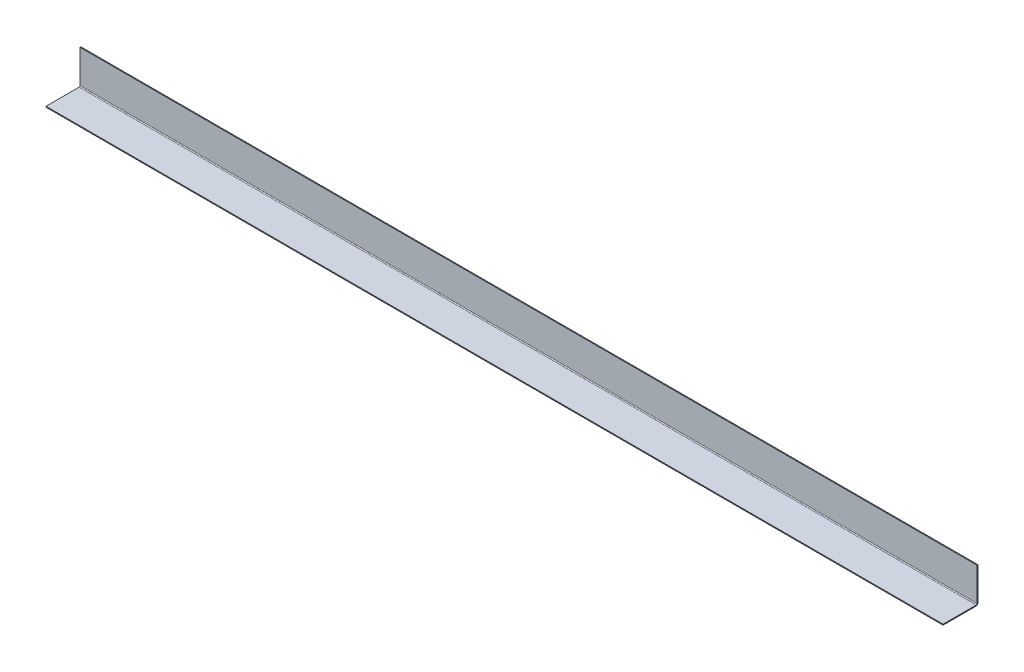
ISO-10303-21;
HEADER;
FILE_DESCRIPTION(('STEP AP214'),'2;1');
FILE_NAME('part.step','',(''),(''),'','','');
FILE_SCHEMA(('AUTOMOTIVE_DESIGN { 1 0 10303 214 1 1 1 1 }'));
ENDSEC;
DATA;
#1=APPLICATION_CONTEXT('core data for automotive mechanical design processes');
#2=APPLICATION_PROTOCOL_DEFINITION('international standard','automotive_design',2000,#1);
#3=PRODUCT_CONTEXT('',#1,'mechanical');
#4=PRODUCT('Part','Part','',(#3));
#5=PRODUCT_RELATED_PRODUCT_CATEGORY('part','',(#4));
#6=PRODUCT_DEFINITION_FORMATION('','',#4);
#7=PRODUCT_DEFINITION_CONTEXT('part definition',#1,'design');
#8=PRODUCT_DEFINITION('design','',#6,#7);
#9=PRODUCT_DEFINITION_SHAPE('','',#8);
#10=(LENGTH_UNIT() NAMED_UNIT(*) SI_UNIT(.MILLI.,.METRE.));
#11=(NAMED_UNIT(*) PLANE_ANGLE_UNIT() SI_UNIT($,.RADIAN.));
#12=(NAMED_UNIT(*) SI_UNIT($,.STERADIAN.) SOLID_ANGLE_UNIT());
#13=UNCERTAINTY_MEASURE_WITH_UNIT(LENGTH_MEASURE(1.E-05),#10,'distance_accuracy_value','');
#14=(GEOMETRIC_REPRESENTATION_CONTEXT(3) GLOBAL_UNCERTAINTY_ASSIGNED_CONTEXT((#13)) GLOBAL_UNIT_ASSIGNED_CONTEXT((#10,
#11,#12)) REPRESENTATION_CONTEXT('',''));
#15=CARTESIAN_POINT('',(0.,0.,0.));
#16=DIRECTION('',(0.,0.,1.));
#17=DIRECTION('',(1.,0.,0.));
#18=AXIS2_PLACEMENT_3D('',#15,#16,#17);
#19=CARTESIAN_POINT('',(1000.,0.356194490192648,77.8438055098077));
#20=DIRECTION('',(0.,1.,0.));
#21=DIRECTION('',(1.,0.,0.));
#22=AXIS2_PLACEMENT_3D('',#19,#20,#21);
#23=PLANE('',#22);
#24=DIRECTION('',(0.,0.,-1.));
#25=VECTOR('',#24,1.);
#26=CARTESIAN_POINT('',(1000.,0.356194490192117,-74.5561944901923));
#27=LINE('',#26,#25);
#28=CARTESIAN_POINT('',(1000.,0.356194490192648,77.8438055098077));
#29=VERTEX_POINT('',#28);
#30=CARTESIAN_POINT('',(1000.,0.356194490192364,4.00000000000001));
#31=VERTEX_POINT('',#30);
#32=EDGE_CURVE('E46',#29,#31,#27,.T.);
#33=ORIENTED_EDGE('',*,*,#32,.T.);
#34=DIRECTION('',(-1.,0.,0.));
#35=VECTOR('',#34,1.);
#36=CARTESIAN_POINT('',(1000.,0.356194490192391,4.00000000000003));
#37=LINE('',#36,#35);
#38=CARTESIAN_POINT('',(-1000.,0.356194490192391,4.00000000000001));
#39=VERTEX_POINT('',#38);
#40=EDGE_CURVE('E113',#31,#39,#37,.T.);
#41=ORIENTED_EDGE('',*,*,#40,.T.);
#42=DIRECTION('',(0.,0.,1.));
#43=VECTOR('',#42,1.);
#44=CARTESIAN_POINT('',(-1000.,0.356194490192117,-74.5561944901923));
#45=LINE('',#44,#43);
#46=CARTESIAN_POINT('',(-1000.,0.356194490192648,77.8438055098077));
#47=VERTEX_POINT('',#46);
#48=EDGE_CURVE('E108',#39,#47,#45,.T.);
#49=ORIENTED_EDGE('',*,*,#48,.T.);
#50=DIRECTION('',(1.,0.,0.));
#51=VECTOR('',#50,1.);
#52=CARTESIAN_POINT('',(-1000.,0.356194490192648,77.8438055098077));
#53=LINE('',#52,#51);
#54=EDGE_CURVE('E67',#47,#29,#53,.T.);
#55=ORIENTED_EDGE('',*,*,#54,.T.);
#56=EDGE_LOOP('',(#33,#41,#49,#55));
#57=FACE_BOUND('',#56,.T.);
#58=ADVANCED_FACE('F42',(#57),#23,.T.);
#59=CARTESIAN_POINT('',(1000.,0.356194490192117,-74.5561944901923));
#60=DIRECTION('',(-1.,0.,0.));
#61=DIRECTION('',(0.,1.,0.));
#62=AXIS2_PLACEMENT_3D('',#59,#60,#61);
#63=PLANE('',#62);
#64=DIRECTION('',(0.,-1.,0.));
#65=VECTOR('',#64,1.);
#66=CARTESIAN_POINT('',(1000.,0.356194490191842,4.00000000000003));
#67=LINE('',#66,#65);
#68=CARTESIAN_POINT('',(1000.,-1.64380550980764,4.00000000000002));
#69=VERTEX_POINT('',#68);
#70=EDGE_CURVE('E118',#31,#69,#67,.T.);
#71=ORIENTED_EDGE('',*,*,#70,.F.);
#72=ORIENTED_EDGE('',*,*,#32,.F.);
#73=DIRECTION('',(0.,-1.,0.));
#74=VECTOR('',#73,1.);
#75=CARTESIAN_POINT('',(1000.,0.356194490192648,77.8438055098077));
#76=LINE('',#75,#74);
#77=CARTESIAN_POINT('',(1000.,-1.64380550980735,77.8438055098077));
#78=VERTEX_POINT('',#77);
#79=EDGE_CURVE('E83',#29,#78,#76,.T.);
#80=ORIENTED_EDGE('',*,*,#79,.T.);
#81=DIRECTION('',(0.,0.,-1.));
#82=VECTOR('',#81,1.);
#83=CARTESIAN_POINT('',(1000.,-1.64380550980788,-74.5561944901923));
#84=LINE('',#83,#82);
#85=EDGE_CURVE('E97',#78,#69,#84,.T.);
#86=ORIENTED_EDGE('',*,*,#85,.T.);
#87=EDGE_LOOP('',(#71,#72,#80,#86));
#88=FACE_BOUND('',#87,.T.);
#89=ADVANCED_FACE('F95',(#88),#63,.F.);
#90=CARTESIAN_POINT('',(-1000.,0.356194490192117,-74.5561944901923));
#91=DIRECTION('',(1.,0.,0.));
#92=DIRECTION('',(0.,-1.,0.));
#93=AXIS2_PLACEMENT_3D('',#90,#91,#92);
#94=PLANE('',#93);
#95=DIRECTION('',(0.,1.,0.));
#96=VECTOR('',#95,1.);
#97=CARTESIAN_POINT('',(-1000.,0.356194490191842,4.00000000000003));
#98=LINE('',#97,#96);
#99=CARTESIAN_POINT('',(-1000.,-1.64380550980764,4.00000000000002));
#100=VERTEX_POINT('',#99);
#101=EDGE_CURVE('E12',#100,#39,#98,.T.);
#102=ORIENTED_EDGE('',*,*,#101,.F.);
#103=DIRECTION('',(0.,0.,1.));
#104=VECTOR('',#103,1.);
#105=CARTESIAN_POINT('',(-1000.,-1.64380550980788,-74.5561944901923));
#106=LINE('',#105,#104);
#107=CARTESIAN_POINT('',(-1000.,-1.64380550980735,77.8438055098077));
#108=VERTEX_POINT('',#107);
#109=EDGE_CURVE('E90',#100,#108,#106,.T.);
#110=ORIENTED_EDGE('',*,*,#109,.T.);
#111=DIRECTION('',(0.,-1.,0.));
#112=VECTOR('',#111,1.);
#113=CARTESIAN_POINT('',(-1000.,0.356194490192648,77.8438055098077));
#114=LINE('',#113,#112);
#115=EDGE_CURVE('E86',#47,#108,#114,.T.);
#116=ORIENTED_EDGE('',*,*,#115,.F.);
#117=ORIENTED_EDGE('',*,*,#48,.F.);
#118=EDGE_LOOP('',(#102,#110,#116,#117));
#119=FACE_BOUND('',#118,.T.);
#120=ADVANCED_FACE('F44',(#119),#94,.F.);
#121=CARTESIAN_POINT('',(-1000.,0.356194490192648,77.8438055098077));
#122=DIRECTION('',(0.,0.,-1.));
#123=DIRECTION('',(0.,1.,0.));
#124=AXIS2_PLACEMENT_3D('',#121,#122,#123);
#125=PLANE('',#124);
#126=DIRECTION('',(1.,0.,0.));
#127=VECTOR('',#126,1.);
#128=CARTESIAN_POINT('',(-1000.,-1.64380550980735,77.8438055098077));
#129=LINE('',#128,#127);
#130=EDGE_CURVE('E80',#108,#78,#129,.T.);
#131=ORIENTED_EDGE('',*,*,#130,.T.);
#132=ORIENTED_EDGE('',*,*,#79,.F.);
#133=ORIENTED_EDGE('',*,*,#54,.F.);
#134=ORIENTED_EDGE('',*,*,#115,.T.);
#135=EDGE_LOOP('',(#131,#132,#133,#134));
#136=FACE_BOUND('',#135,.T.);
#137=ADVANCED_FACE('F82',(#136),#125,.F.);
#138=CARTESIAN_POINT('',(1000.,-1.64380550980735,77.8438055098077));
#139=DIRECTION('',(0.,1.,0.));
#140=DIRECTION('',(1.,0.,0.));
#141=AXIS2_PLACEMENT_3D('',#138,#139,#140);
#142=PLANE('',#141);
#143=DIRECTION('',(-1.,0.,0.));
#144=VECTOR('',#143,1.);
#145=CARTESIAN_POINT('',(1000.,-1.64380550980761,4.00000000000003));
#146=LINE('',#145,#144);
#147=EDGE_CURVE('E51',#69,#100,#146,.T.);
#148=ORIENTED_EDGE('',*,*,#147,.F.);
#149=ORIENTED_EDGE('',*,*,#85,.F.);
#150=ORIENTED_EDGE('',*,*,#130,.F.);
#151=ORIENTED_EDGE('',*,*,#109,.F.);
#152=EDGE_LOOP('',(#148,#149,#150,#151));
#153=FACE_BOUND('',#152,.T.);
#154=ADVANCED_FACE('F100',(#153),#142,.F.);
#155=CARTESIAN_POINT('',(-1000.,76.2,2.));
#156=DIRECTION('',(0.,-1.,0.));
#157=DIRECTION('',(0.,0.,-1.));
#158=AXIS2_PLACEMENT_3D('',#155,#156,#157);
#159=PLANE('',#158);
#160=DIRECTION('',(-1.,0.,0.));
#161=VECTOR('',#160,1.);
#162=CARTESIAN_POINT('',(-1000.,76.2,0.));
#163=LINE('',#162,#161);
#164=CARTESIAN_POINT('',(1000.,76.2,0.));
#165=VERTEX_POINT('',#164);
#166=CARTESIAN_POINT('',(-1000.,76.2,0.));
#167=VERTEX_POINT('',#166);
#168=EDGE_CURVE('E130',#165,#167,#163,.T.);
#169=ORIENTED_EDGE('',*,*,#168,.T.);
#170=DIRECTION('',(0.,0.,-1.));
#171=VECTOR('',#170,1.);
#172=CARTESIAN_POINT('',(-1000.,76.2,2.));
#173=LINE('',#172,#171);
#174=CARTESIAN_POINT('',(-1000.,76.2,2.));
#175=VERTEX_POINT('',#174);
#176=EDGE_CURVE('E102',#175,#167,#173,.T.);
#177=ORIENTED_EDGE('',*,*,#176,.F.);
#178=DIRECTION('',(-1.,0.,0.));
#179=VECTOR('',#178,1.);
#180=CARTESIAN_POINT('',(-1000.,76.2,2.));
#181=LINE('',#180,#179);
#182=CARTESIAN_POINT('',(1000.,76.2,2.));
#183=VERTEX_POINT('',#182);
#184=EDGE_CURVE('E139',#183,#175,#181,.T.);
#185=ORIENTED_EDGE('',*,*,#184,.F.);
#186=DIRECTION('',(0.,0.,-1.));
#187=VECTOR('',#186,1.);
#188=CARTESIAN_POINT('',(1000.,76.2,2.));
#189=LINE('',#188,#187);
#190=EDGE_CURVE('E133',#183,#165,#189,.T.);
#191=ORIENTED_EDGE('',*,*,#190,.T.);
#192=EDGE_LOOP('',(#169,#177,#185,#191));
#193=FACE_BOUND('',#192,.T.);
#194=ADVANCED_FACE('F188',(#193),#159,.F.);
#195=CARTESIAN_POINT('',(1000.,-76.2,2.));
#196=DIRECTION('',(0.,0.,1.));
#197=DIRECTION('',(1.,0.,0.));
#198=AXIS2_PLACEMENT_3D('',#195,#196,#197);
#199=PLANE('',#198);
#200=DIRECTION('',(-1.,0.,0.));
#201=VECTOR('',#200,1.);
#202=CARTESIAN_POINT('',(1000.,2.35619449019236,2.));
#203=LINE('',#202,#201);
#204=CARTESIAN_POINT('',(1000.,2.35619449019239,2.));
#205=VERTEX_POINT('',#204);
#206=CARTESIAN_POINT('',(-1000.,2.35619449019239,2.));
#207=VERTEX_POINT('',#206);
#208=EDGE_CURVE('E128',#205,#207,#203,.T.);
#209=ORIENTED_EDGE('',*,*,#208,.F.);
#210=DIRECTION('',(0.,1.,0.));
#211=VECTOR('',#210,1.);
#212=CARTESIAN_POINT('',(1000.,76.2,2.));
#213=LINE('',#212,#211);
#214=EDGE_CURVE('E136',#205,#183,#213,.T.);
#215=ORIENTED_EDGE('',*,*,#214,.T.);
#216=ORIENTED_EDGE('',*,*,#184,.T.);
#217=DIRECTION('',(0.,-1.,0.));
#218=VECTOR('',#217,1.);
#219=CARTESIAN_POINT('',(-1000.,76.2,2.));
#220=LINE('',#219,#218);
#221=EDGE_CURVE('E142',#175,#207,#220,.T.);
#222=ORIENTED_EDGE('',*,*,#221,.T.);
#223=EDGE_LOOP('',(#209,#215,#216,#222));
#224=FACE_BOUND('',#223,.T.);
#225=ADVANCED_FACE('F174',(#224),#199,.T.);
#226=CARTESIAN_POINT('',(1000.,76.2,2.));
#227=DIRECTION('',(-1.,0.,0.));
#228=DIRECTION('',(0.,0.,1.));
#229=AXIS2_PLACEMENT_3D('',#226,#227,#228);
#230=PLANE('',#229);
#231=ORIENTED_EDGE('',*,*,#214,.F.);
#232=DIRECTION('',(0.,0.,-1.));
#233=VECTOR('',#232,1.);
#234=CARTESIAN_POINT('',(1000.,2.35619449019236,1.99999999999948));
#235=LINE('',#234,#233);
#236=CARTESIAN_POINT('',(1000.,2.35619449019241,0.));
#237=VERTEX_POINT('',#236);
#238=EDGE_CURVE('E145',#205,#237,#235,.T.);
#239=ORIENTED_EDGE('',*,*,#238,.T.);
#240=DIRECTION('',(0.,1.,0.));
#241=VECTOR('',#240,1.);
#242=CARTESIAN_POINT('',(1000.,76.2,0.));
#243=LINE('',#242,#241);
#244=EDGE_CURVE('E148',#237,#165,#243,.T.);
#245=ORIENTED_EDGE('',*,*,#244,.T.);
#246=ORIENTED_EDGE('',*,*,#190,.F.);
#247=EDGE_LOOP('',(#231,#239,#245,#246));
#248=FACE_BOUND('',#247,.T.);
#249=ADVANCED_FACE('F180',(#248),#230,.F.);
#250=CARTESIAN_POINT('',(1000.,-76.2,0.));
#251=DIRECTION('',(0.,0.,1.));
#252=DIRECTION('',(1.,0.,0.));
#253=AXIS2_PLACEMENT_3D('',#250,#251,#252);
#254=PLANE('',#253);
#255=ORIENTED_EDGE('',*,*,#244,.F.);
#256=DIRECTION('',(-1.,0.,0.));
#257=VECTOR('',#256,1.);
#258=CARTESIAN_POINT('',(1000.,2.35619449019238,0.));
#259=LINE('',#258,#257);
#260=CARTESIAN_POINT('',(-1000.,2.35619449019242,0.));
#261=VERTEX_POINT('',#260);
#262=EDGE_CURVE('E151',#237,#261,#259,.T.);
#263=ORIENTED_EDGE('',*,*,#262,.T.);
#264=DIRECTION('',(0.,-1.,0.));
#265=VECTOR('',#264,1.);
#266=CARTESIAN_POINT('',(-1000.,76.2,0.));
#267=LINE('',#266,#265);
#268=EDGE_CURVE('E154',#167,#261,#267,.T.);
#269=ORIENTED_EDGE('',*,*,#268,.F.);
#270=ORIENTED_EDGE('',*,*,#168,.F.);
#271=EDGE_LOOP('',(#255,#263,#269,#270));
#272=FACE_BOUND('',#271,.T.);
#273=ADVANCED_FACE('F233',(#272),#254,.F.);
#274=CARTESIAN_POINT('',(-1000.,76.2,2.));
#275=DIRECTION('',(1.,0.,0.));
#276=DIRECTION('',(0.,0.,-1.));
#277=AXIS2_PLACEMENT_3D('',#274,#275,#276);
#278=PLANE('',#277);
#279=ORIENTED_EDGE('',*,*,#268,.T.);
#280=DIRECTION('',(0.,0.,1.));
#281=VECTOR('',#280,1.);
#282=CARTESIAN_POINT('',(-1000.,2.35619449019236,1.99999999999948));
#283=LINE('',#282,#281);
#284=EDGE_CURVE('E106',#261,#207,#283,.T.);
#285=ORIENTED_EDGE('',*,*,#284,.T.);
#286=ORIENTED_EDGE('',*,*,#221,.F.);
#287=ORIENTED_EDGE('',*,*,#176,.T.);
#288=EDGE_LOOP('',(#279,#285,#286,#287));
#289=FACE_BOUND('',#288,.T.);
#290=ADVANCED_FACE('F235',(#289),#278,.F.);
#291=CARTESIAN_POINT('',(1000.,2.35619449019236,4.));
#292=DIRECTION('',(-1.,0.,0.));
#293=DIRECTION('',(0.,0.,1.));
#294=AXIS2_PLACEMENT_3D('',#291,#292,#293);
#295=PLANE('',#294);
#296=ORIENTED_EDGE('',*,*,#70,.T.);
#297=CARTESIAN_POINT('',(1000.,2.35619449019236,4.));
#298=DIRECTION('',(1.,0.,0.));
#299=DIRECTION('',(0.,0.,-1.));
#300=AXIS2_PLACEMENT_3D('',#297,#298,#299);
#301=CIRCLE('',#300,4.);
#302=EDGE_CURVE('E163',#69,#237,#301,.T.);
#303=ORIENTED_EDGE('',*,*,#302,.T.);
#304=ORIENTED_EDGE('',*,*,#238,.F.);
#305=CARTESIAN_POINT('',(1000.,2.35619449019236,4.));
#306=DIRECTION('',(1.,0.,0.));
#307=DIRECTION('',(0.,0.,-1.));
#308=AXIS2_PLACEMENT_3D('',#305,#306,#307);
#309=CIRCLE('',#308,2.);
#310=EDGE_CURVE('E162',#31,#205,#309,.T.);
#311=ORIENTED_EDGE('',*,*,#310,.F.);
#312=EDGE_LOOP('',(#296,#303,#304,#311));
#313=FACE_BOUND('',#312,.T.);
#314=ADVANCED_FACE('F238',(#313),#295,.F.);
#315=CARTESIAN_POINT('',(-1000.,2.35619449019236,4.));
#316=DIRECTION('',(1.,0.,0.));
#317=DIRECTION('',(0.,0.,-1.));
#318=AXIS2_PLACEMENT_3D('',#315,#316,#317);
#319=PLANE('',#318);
#320=CARTESIAN_POINT('',(-1000.,2.35619449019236,4.));
#321=DIRECTION('',(1.,0.,0.));
#322=DIRECTION('',(0.,0.,-1.));
#323=AXIS2_PLACEMENT_3D('',#320,#321,#322);
#324=CIRCLE('',#323,4.);
#325=EDGE_CURVE('E159',#261,#100,#324,.F.);
#326=ORIENTED_EDGE('',*,*,#325,.T.);
#327=ORIENTED_EDGE('',*,*,#101,.T.);
#328=CARTESIAN_POINT('',(-1000.,2.35619449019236,4.));
#329=DIRECTION('',(-1.,0.,0.));
#330=DIRECTION('',(0.,0.,1.));
#331=AXIS2_PLACEMENT_3D('',#328,#329,#330);
#332=CIRCLE('',#331,2.);
#333=EDGE_CURVE('E59',#207,#39,#332,.T.);
#334=ORIENTED_EDGE('',*,*,#333,.F.);
#335=ORIENTED_EDGE('',*,*,#284,.F.);
#336=EDGE_LOOP('',(#326,#327,#334,#335));
#337=FACE_BOUND('',#336,.T.);
#338=ADVANCED_FACE('F204',(#337),#319,.F.);
#339=CARTESIAN_POINT('',(-2000.00655164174,2.35619449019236,4.));
#340=DIRECTION('',(1.,0.,0.));
#341=DIRECTION('',(0.,0.,-1.));
#342=AXIS2_PLACEMENT_3D('',#339,#340,#341);
#343=CYLINDRICAL_SURFACE('',#342,2.);
#344=ORIENTED_EDGE('',*,*,#208,.T.);
#345=ORIENTED_EDGE('',*,*,#333,.T.);
#346=ORIENTED_EDGE('',*,*,#40,.F.);
#347=ORIENTED_EDGE('',*,*,#310,.T.);
#348=EDGE_LOOP('',(#344,#345,#346,#347));
#349=FACE_BOUND('',#348,.T.);
#350=ADVANCED_FACE('F168',(#349),#343,.F.);
#351=CARTESIAN_POINT('',(-2000.00655164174,2.35619449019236,4.));
#352=DIRECTION('',(1.,0.,0.));
#353=DIRECTION('',(0.,0.,-1.));
#354=AXIS2_PLACEMENT_3D('',#351,#352,#353);
#355=CYLINDRICAL_SURFACE('',#354,4.);
#356=ORIENTED_EDGE('',*,*,#262,.F.);
#357=ORIENTED_EDGE('',*,*,#302,.F.);
#358=ORIENTED_EDGE('',*,*,#147,.T.);
#359=ORIENTED_EDGE('',*,*,#325,.F.);
#360=EDGE_LOOP('',(#356,#357,#358,#359));
#361=FACE_BOUND('',#360,.T.);
#362=ADVANCED_FACE('F201',(#361),#355,.T.);
#363=CLOSED_SHELL('',(#58,#89,#120,#137,#154,#194,#225,#249,#273,#290,#314,#338,#350,#362));
#364=MANIFOLD_SOLID_BREP('B2',#363);
#365=ADVANCED_BREP_SHAPE_REPRESENTATION('',(#18,#364),#14);
#366=SHAPE_DEFINITION_REPRESENTATION(#9,#365);
ENDSEC;
END-ISO-10303-21;
